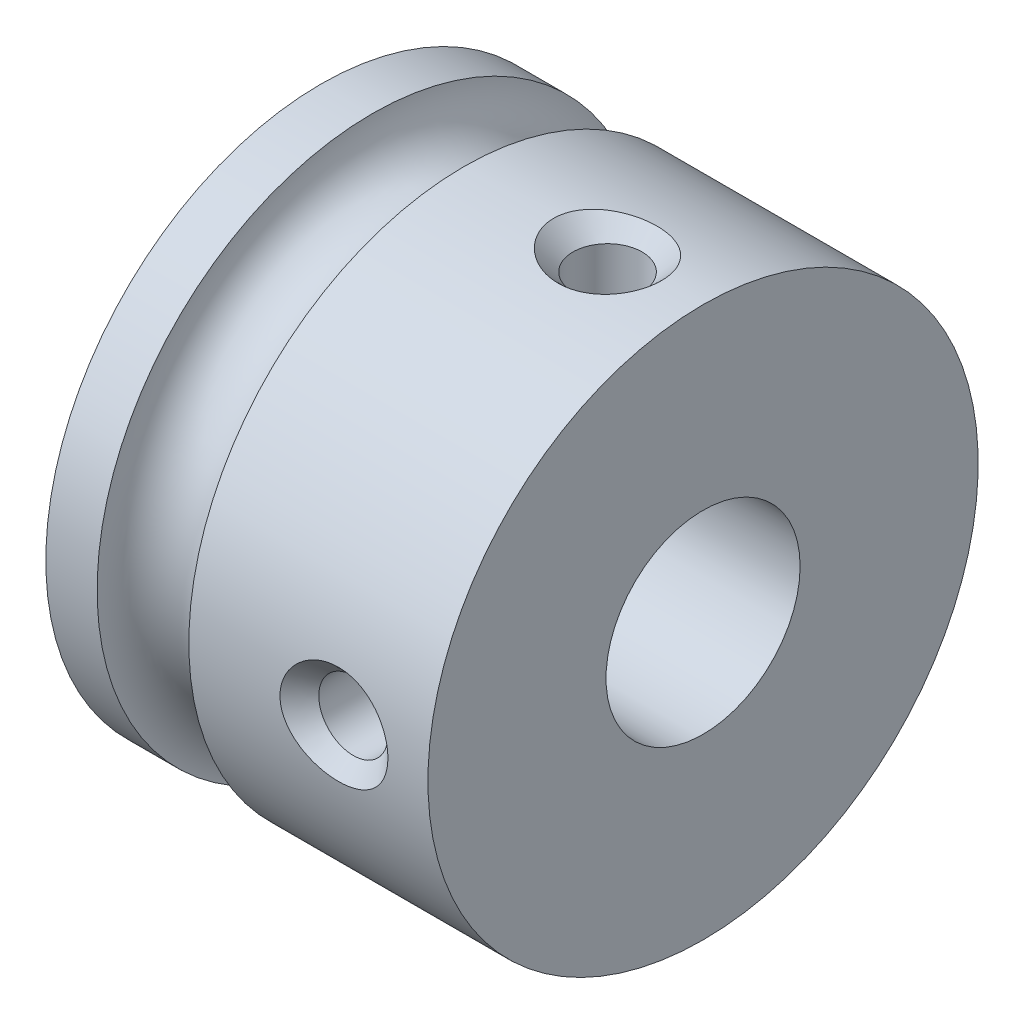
from build123d import *

# Parameters (mm, degrees)
F_1_4_0_25_DIAMETER_HOLE1_D = 6.35


with BuildPart() as part:
    # Sketch1 → Revolve1 (revolve)
    with BuildSketch(Plane.XY, mode=Mode.PRIVATE) as revolve1_sk:
        with BuildLine():
            Line((-6.25, 9), (-4.571460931, 9))
            ThreePointArc((-4.571460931, 9), (-3.071460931, 7.5), (-1.571460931, 9))
            Line((-1.571460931, 9), (6.25, 9))
            Line((6.25, 9), (6.25, 0))
            Line((6.25, 0), (-6.25, 0))
            Line((-6.25, 0), (-6.25, 9))
        make_face()
    revolve(revolve1_sk.sketch.rotate(Axis((-27.982188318, 0, 0), (1, 0, 0)), 180), axis=Axis((-27.982188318, 0, 0), (1, 0, 0)))

    # 1_4 _0.25_ Diameter Hole1 (through all)
    with Locations(Plane(origin=(6.25, 0, 0), x_dir=(0, 0, -1), z_dir=(1, 0, 0))):
        with Locations((0, 0)):
            Hole(F_1_4_0_25_DIAMETER_HOLE1_D / 2)

    # Sketch9 → 4-40 Tapped Hole3 (revolve, cut)
    with BuildSketch(Plane(origin=(3.125, 0, 0), x_dir=(0, 0, -1), z_dir=(1, 0, 0))):
        Polygon((0, 0), (0, 9), (1.7653, 9), (1.1303, 8.365), (1.1303, 0), align=None)
    revolve(axis=Axis((3.125, -6.35, 0), (0, 1, 0)), mode=Mode.SUBTRACT)

    # Sketch13 → 4-40 Tapped Hole4 (revolve, cut)
    with BuildSketch(Plane.YZ.offset(3.175)):
        Polygon((0, 0), (0, 9), (1.7653, 9), (1.1303, 8.365), (1.1303, 0), align=None)
    revolve(axis=Axis((3.175, 0, -6.35), (0, 0, 1)), mode=Mode.SUBTRACT)


solid = part.part
